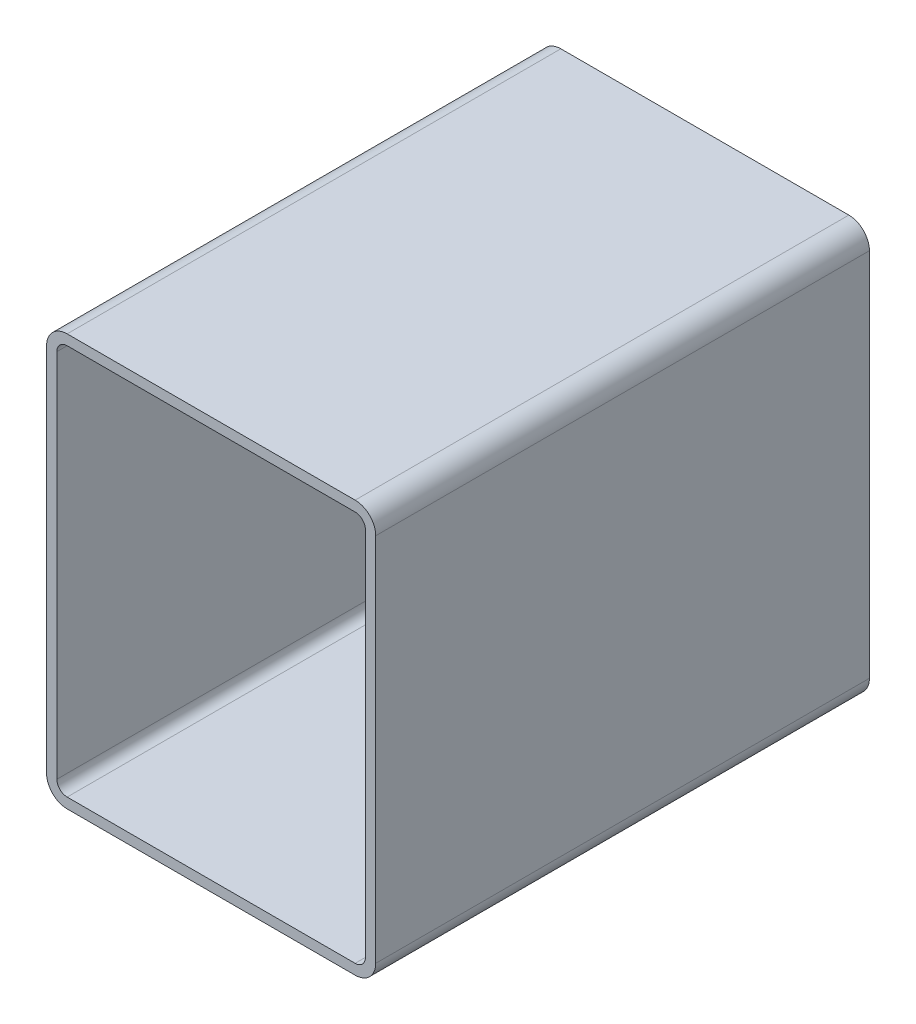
ISO-10303-21;
HEADER;
FILE_DESCRIPTION(('STEP AP214'),'2;1');
FILE_NAME('part.step','',(''),(''),'','','');
FILE_SCHEMA(('AUTOMOTIVE_DESIGN { 1 0 10303 214 1 1 1 1 }'));
ENDSEC;
DATA;
#1=APPLICATION_CONTEXT('core data for automotive mechanical design processes');
#2=APPLICATION_PROTOCOL_DEFINITION('international standard','automotive_design',2000,#1);
#3=PRODUCT_CONTEXT('',#1,'mechanical');
#4=PRODUCT('Part','Part','',(#3));
#5=PRODUCT_RELATED_PRODUCT_CATEGORY('part','',(#4));
#6=PRODUCT_DEFINITION_FORMATION('','',#4);
#7=PRODUCT_DEFINITION_CONTEXT('part definition',#1,'design');
#8=PRODUCT_DEFINITION('design','',#6,#7);
#9=PRODUCT_DEFINITION_SHAPE('','',#8);
#10=(LENGTH_UNIT() NAMED_UNIT(*) SI_UNIT(.MILLI.,.METRE.));
#11=(NAMED_UNIT(*) PLANE_ANGLE_UNIT() SI_UNIT($,.RADIAN.));
#12=(NAMED_UNIT(*) SI_UNIT($,.STERADIAN.) SOLID_ANGLE_UNIT());
#13=UNCERTAINTY_MEASURE_WITH_UNIT(LENGTH_MEASURE(1.E-05),#10,'distance_accuracy_value','');
#14=(GEOMETRIC_REPRESENTATION_CONTEXT(3) GLOBAL_UNCERTAINTY_ASSIGNED_CONTEXT((#13)) GLOBAL_UNIT_ASSIGNED_CONTEXT((#10,
#11,#12)) REPRESENTATION_CONTEXT('',''));
#15=CARTESIAN_POINT('',(0.,0.,0.));
#16=DIRECTION('',(0.,0.,1.));
#17=DIRECTION('',(1.,0.,0.));
#18=AXIS2_PLACEMENT_3D('',#15,#16,#17);
#19=CARTESIAN_POINT('',(14.0909404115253,243.220313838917,304.8));
#20=DIRECTION('',(0.,0.,1.));
#21=DIRECTION('',(1.,0.,0.));
#22=AXIS2_PLACEMENT_3D('',#19,#20,#21);
#23=PLANE('',#22);
#24=CARTESIAN_POINT('',(14.0909404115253,243.220313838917,304.8));
#25=DIRECTION('',(0.,0.,1.));
#26=DIRECTION('',(1.,0.,0.));
#27=AXIS2_PLACEMENT_3D('',#24,#25,#26);
#28=CIRCLE('',#27,12.7);
#29=CARTESIAN_POINT('',(14.0909404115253,255.920313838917,304.8));
#30=VERTEX_POINT('',#29);
#31=CARTESIAN_POINT('',(1.3909404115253,243.220313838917,304.8));
#32=VERTEX_POINT('',#31);
#33=EDGE_CURVE('E211',#30,#32,#28,.T.);
#34=ORIENTED_EDGE('',*,*,#33,.T.);
#35=DIRECTION('',(0.,-1.,0.));
#36=VECTOR('',#35,1.);
#37=CARTESIAN_POINT('',(1.3909404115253,14.6203138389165,304.8));
#38=LINE('',#37,#36);
#39=CARTESIAN_POINT('',(1.3909404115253,14.6203138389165,304.8));
#40=VERTEX_POINT('',#39);
#41=EDGE_CURVE('E214',#32,#40,#38,.T.);
#42=ORIENTED_EDGE('',*,*,#41,.T.);
#43=CARTESIAN_POINT('',(14.0909404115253,14.6203138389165,304.8));
#44=DIRECTION('',(0.,0.,1.));
#45=DIRECTION('',(1.,0.,0.));
#46=AXIS2_PLACEMENT_3D('',#43,#44,#45);
#47=CIRCLE('',#46,12.7);
#48=CARTESIAN_POINT('',(14.0909404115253,1.92031383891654,304.8));
#49=VERTEX_POINT('',#48);
#50=EDGE_CURVE('E217',#40,#49,#47,.T.);
#51=ORIENTED_EDGE('',*,*,#50,.T.);
#52=DIRECTION('',(1.,0.,0.));
#53=VECTOR('',#52,1.);
#54=CARTESIAN_POINT('',(191.890940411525,1.92031383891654,304.8));
#55=LINE('',#54,#53);
#56=CARTESIAN_POINT('',(191.890940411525,1.92031383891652,304.8));
#57=VERTEX_POINT('',#56);
#58=EDGE_CURVE('E219',#49,#57,#55,.T.);
#59=ORIENTED_EDGE('',*,*,#58,.T.);
#60=CARTESIAN_POINT('',(191.890940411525,14.6203138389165,304.8));
#61=DIRECTION('',(0.,0.,1.));
#62=DIRECTION('',(1.,0.,0.));
#63=AXIS2_PLACEMENT_3D('',#60,#61,#62);
#64=CIRCLE('',#63,12.7);
#65=CARTESIAN_POINT('',(204.590940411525,14.6203138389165,304.8));
#66=VERTEX_POINT('',#65);
#67=EDGE_CURVE('E221',#57,#66,#64,.T.);
#68=ORIENTED_EDGE('',*,*,#67,.T.);
#69=DIRECTION('',(0.,1.,0.));
#70=VECTOR('',#69,1.);
#71=CARTESIAN_POINT('',(204.590940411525,243.220313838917,304.8));
#72=LINE('',#71,#70);
#73=CARTESIAN_POINT('',(204.590940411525,243.220313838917,304.8));
#74=VERTEX_POINT('',#73);
#75=EDGE_CURVE('E223',#66,#74,#72,.T.);
#76=ORIENTED_EDGE('',*,*,#75,.T.);
#77=CARTESIAN_POINT('',(191.890940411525,243.220313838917,304.8));
#78=DIRECTION('',(0.,0.,1.));
#79=DIRECTION('',(1.,0.,0.));
#80=AXIS2_PLACEMENT_3D('',#77,#78,#79);
#81=CIRCLE('',#80,12.7);
#82=CARTESIAN_POINT('',(191.890940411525,255.920313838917,304.8));
#83=VERTEX_POINT('',#82);
#84=EDGE_CURVE('E225',#74,#83,#81,.T.);
#85=ORIENTED_EDGE('',*,*,#84,.T.);
#86=DIRECTION('',(-1.,0.,0.));
#87=VECTOR('',#86,1.);
#88=CARTESIAN_POINT('',(14.0909404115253,255.920313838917,304.8));
#89=LINE('',#88,#87);
#90=EDGE_CURVE('E227',#83,#30,#89,.T.);
#91=ORIENTED_EDGE('',*,*,#90,.T.);
#92=EDGE_LOOP('',(#34,#42,#51,#59,#68,#76,#85,#91));
#93=FACE_BOUND('',#92,.T.);
#94=DIRECTION('',(0.,-1.,0.));
#95=VECTOR('',#94,1.);
#96=CARTESIAN_POINT('',(7.7409404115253,14.6203138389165,304.8));
#97=LINE('',#96,#95);
#98=CARTESIAN_POINT('',(7.7409404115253,243.220313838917,304.8));
#99=VERTEX_POINT('',#98);
#100=CARTESIAN_POINT('',(7.7409404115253,14.6203138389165,304.8));
#101=VERTEX_POINT('',#100);
#102=EDGE_CURVE('E154',#99,#101,#97,.T.);
#103=ORIENTED_EDGE('',*,*,#102,.F.);
#104=CARTESIAN_POINT('',(14.0909404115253,243.220313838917,304.8));
#105=DIRECTION('',(0.,0.,1.));
#106=DIRECTION('',(1.,0.,0.));
#107=AXIS2_PLACEMENT_3D('',#104,#105,#106);
#108=CIRCLE('',#107,6.35000000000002);
#109=CARTESIAN_POINT('',(14.0909404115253,249.570313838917,304.8));
#110=VERTEX_POINT('',#109);
#111=EDGE_CURVE('E146',#110,#99,#108,.T.);
#112=ORIENTED_EDGE('',*,*,#111,.F.);
#113=DIRECTION('',(-1.,0.,0.));
#114=VECTOR('',#113,1.);
#115=CARTESIAN_POINT('',(14.0909404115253,249.570313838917,304.8));
#116=LINE('',#115,#114);
#117=CARTESIAN_POINT('',(191.890940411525,249.570313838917,304.8));
#118=VERTEX_POINT('',#117);
#119=EDGE_CURVE('E179',#118,#110,#116,.T.);
#120=ORIENTED_EDGE('',*,*,#119,.F.);
#121=CARTESIAN_POINT('',(191.890940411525,243.220313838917,304.8));
#122=DIRECTION('',(0.,0.,1.));
#123=DIRECTION('',(1.,0.,0.));
#124=AXIS2_PLACEMENT_3D('',#121,#122,#123);
#125=CIRCLE('',#124,6.35000000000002);
#126=CARTESIAN_POINT('',(198.240940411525,243.220313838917,304.8));
#127=VERTEX_POINT('',#126);
#128=EDGE_CURVE('E177',#127,#118,#125,.T.);
#129=ORIENTED_EDGE('',*,*,#128,.F.);
#130=DIRECTION('',(0.,1.,0.));
#131=VECTOR('',#130,1.);
#132=CARTESIAN_POINT('',(198.240940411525,243.220313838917,304.8));
#133=LINE('',#132,#131);
#134=CARTESIAN_POINT('',(198.240940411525,14.6203138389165,304.8));
#135=VERTEX_POINT('',#134);
#136=EDGE_CURVE('E175',#135,#127,#133,.T.);
#137=ORIENTED_EDGE('',*,*,#136,.F.);
#138=CARTESIAN_POINT('',(191.890940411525,14.6203138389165,304.8));
#139=DIRECTION('',(0.,0.,1.));
#140=DIRECTION('',(1.,0.,0.));
#141=AXIS2_PLACEMENT_3D('',#138,#139,#140);
#142=CIRCLE('',#141,6.35000000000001);
#143=CARTESIAN_POINT('',(191.890940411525,8.27031383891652,304.8));
#144=VERTEX_POINT('',#143);
#145=EDGE_CURVE('E173',#144,#135,#142,.T.);
#146=ORIENTED_EDGE('',*,*,#145,.F.);
#147=DIRECTION('',(1.,0.,0.));
#148=VECTOR('',#147,1.);
#149=CARTESIAN_POINT('',(191.890940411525,8.27031383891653,304.8));
#150=LINE('',#149,#148);
#151=CARTESIAN_POINT('',(14.0909404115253,8.27031383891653,304.8));
#152=VERTEX_POINT('',#151);
#153=EDGE_CURVE('E169',#152,#144,#150,.T.);
#154=ORIENTED_EDGE('',*,*,#153,.F.);
#155=CARTESIAN_POINT('',(14.0909404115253,14.6203138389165,304.8));
#156=DIRECTION('',(0.,0.,1.));
#157=DIRECTION('',(1.,0.,0.));
#158=AXIS2_PLACEMENT_3D('',#155,#156,#157);
#159=CIRCLE('',#158,6.35);
#160=EDGE_CURVE('E167',#101,#152,#159,.T.);
#161=ORIENTED_EDGE('',*,*,#160,.F.);
#162=EDGE_LOOP('',(#103,#112,#120,#129,#137,#146,#154,#161));
#163=FACE_BOUND('',#162,.T.);
#164=ADVANCED_FACE('F33',(#93,#163),#23,.T.);
#165=CARTESIAN_POINT('',(14.0909404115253,243.220313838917,0.));
#166=DIRECTION('',(0.,0.,1.));
#167=DIRECTION('',(1.,0.,0.));
#168=AXIS2_PLACEMENT_3D('',#165,#166,#167);
#169=PLANE('',#168);
#170=CARTESIAN_POINT('',(14.0909404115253,243.220313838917,0.));
#171=DIRECTION('',(0.,0.,1.));
#172=DIRECTION('',(1.,0.,0.));
#173=AXIS2_PLACEMENT_3D('',#170,#171,#172);
#174=CIRCLE('',#173,12.7);
#175=CARTESIAN_POINT('',(14.0909404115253,255.920313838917,0.));
#176=VERTEX_POINT('',#175);
#177=CARTESIAN_POINT('',(1.3909404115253,243.220313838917,0.));
#178=VERTEX_POINT('',#177);
#179=EDGE_CURVE('E162',#176,#178,#174,.T.);
#180=ORIENTED_EDGE('',*,*,#179,.F.);
#181=DIRECTION('',(-1.,0.,0.));
#182=VECTOR('',#181,1.);
#183=CARTESIAN_POINT('',(14.0909404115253,255.920313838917,0.));
#184=LINE('',#183,#182);
#185=CARTESIAN_POINT('',(191.890940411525,255.920313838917,0.));
#186=VERTEX_POINT('',#185);
#187=EDGE_CURVE('E215',#186,#176,#184,.T.);
#188=ORIENTED_EDGE('',*,*,#187,.F.);
#189=CARTESIAN_POINT('',(191.890940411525,243.220313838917,0.));
#190=DIRECTION('',(0.,0.,1.));
#191=DIRECTION('',(1.,0.,0.));
#192=AXIS2_PLACEMENT_3D('',#189,#190,#191);
#193=CIRCLE('',#192,12.7);
#194=CARTESIAN_POINT('',(204.590940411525,243.220313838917,0.));
#195=VERTEX_POINT('',#194);
#196=EDGE_CURVE('E242',#195,#186,#193,.T.);
#197=ORIENTED_EDGE('',*,*,#196,.F.);
#198=DIRECTION('',(0.,1.,0.));
#199=VECTOR('',#198,1.);
#200=CARTESIAN_POINT('',(204.590940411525,243.220313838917,0.));
#201=LINE('',#200,#199);
#202=CARTESIAN_POINT('',(204.590940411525,14.6203138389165,0.));
#203=VERTEX_POINT('',#202);
#204=EDGE_CURVE('E240',#203,#195,#201,.T.);
#205=ORIENTED_EDGE('',*,*,#204,.F.);
#206=CARTESIAN_POINT('',(191.890940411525,14.6203138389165,0.));
#207=DIRECTION('',(0.,0.,1.));
#208=DIRECTION('',(1.,0.,0.));
#209=AXIS2_PLACEMENT_3D('',#206,#207,#208);
#210=CIRCLE('',#209,12.7);
#211=CARTESIAN_POINT('',(191.890940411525,1.92031383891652,0.));
#212=VERTEX_POINT('',#211);
#213=EDGE_CURVE('E238',#212,#203,#210,.T.);
#214=ORIENTED_EDGE('',*,*,#213,.F.);
#215=DIRECTION('',(1.,0.,0.));
#216=VECTOR('',#215,1.);
#217=CARTESIAN_POINT('',(191.890940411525,1.92031383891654,0.));
#218=LINE('',#217,#216);
#219=CARTESIAN_POINT('',(14.0909404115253,1.92031383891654,0.));
#220=VERTEX_POINT('',#219);
#221=EDGE_CURVE('E236',#220,#212,#218,.T.);
#222=ORIENTED_EDGE('',*,*,#221,.F.);
#223=CARTESIAN_POINT('',(14.0909404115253,14.6203138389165,0.));
#224=DIRECTION('',(0.,0.,1.));
#225=DIRECTION('',(1.,0.,0.));
#226=AXIS2_PLACEMENT_3D('',#223,#224,#225);
#227=CIRCLE('',#226,12.7);
#228=CARTESIAN_POINT('',(1.3909404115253,14.6203138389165,0.));
#229=VERTEX_POINT('',#228);
#230=EDGE_CURVE('E234',#229,#220,#227,.T.);
#231=ORIENTED_EDGE('',*,*,#230,.F.);
#232=DIRECTION('',(0.,-1.,0.));
#233=VECTOR('',#232,1.);
#234=CARTESIAN_POINT('',(1.3909404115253,14.6203138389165,0.));
#235=LINE('',#234,#233);
#236=EDGE_CURVE('E232',#178,#229,#235,.T.);
#237=ORIENTED_EDGE('',*,*,#236,.F.);
#238=EDGE_LOOP('',(#180,#188,#197,#205,#214,#222,#231,#237));
#239=FACE_BOUND('',#238,.T.);
#240=CARTESIAN_POINT('',(14.0909404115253,243.220313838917,0.));
#241=DIRECTION('',(0.,0.,1.));
#242=DIRECTION('',(1.,0.,0.));
#243=AXIS2_PLACEMENT_3D('',#240,#241,#242);
#244=CIRCLE('',#243,6.35000000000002);
#245=CARTESIAN_POINT('',(14.0909404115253,249.570313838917,0.));
#246=VERTEX_POINT('',#245);
#247=CARTESIAN_POINT('',(7.7409404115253,243.220313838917,0.));
#248=VERTEX_POINT('',#247);
#249=EDGE_CURVE('E56',#246,#248,#244,.T.);
#250=ORIENTED_EDGE('',*,*,#249,.T.);
#251=DIRECTION('',(0.,-1.,0.));
#252=VECTOR('',#251,1.);
#253=CARTESIAN_POINT('',(7.7409404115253,14.6203138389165,0.));
#254=LINE('',#253,#252);
#255=CARTESIAN_POINT('',(7.7409404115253,14.6203138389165,0.));
#256=VERTEX_POINT('',#255);
#257=EDGE_CURVE('E161',#248,#256,#254,.T.);
#258=ORIENTED_EDGE('',*,*,#257,.T.);
#259=CARTESIAN_POINT('',(14.0909404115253,14.6203138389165,0.));
#260=DIRECTION('',(0.,0.,1.));
#261=DIRECTION('',(1.,0.,0.));
#262=AXIS2_PLACEMENT_3D('',#259,#260,#261);
#263=CIRCLE('',#262,6.35);
#264=CARTESIAN_POINT('',(14.0909404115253,8.27031383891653,0.));
#265=VERTEX_POINT('',#264);
#266=EDGE_CURVE('E183',#256,#265,#263,.T.);
#267=ORIENTED_EDGE('',*,*,#266,.T.);
#268=DIRECTION('',(1.,0.,0.));
#269=VECTOR('',#268,1.);
#270=CARTESIAN_POINT('',(191.890940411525,8.27031383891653,0.));
#271=LINE('',#270,#269);
#272=CARTESIAN_POINT('',(191.890940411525,8.27031383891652,0.));
#273=VERTEX_POINT('',#272);
#274=EDGE_CURVE('E186',#265,#273,#271,.T.);
#275=ORIENTED_EDGE('',*,*,#274,.T.);
#276=CARTESIAN_POINT('',(191.890940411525,14.6203138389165,0.));
#277=DIRECTION('',(0.,0.,1.));
#278=DIRECTION('',(1.,0.,0.));
#279=AXIS2_PLACEMENT_3D('',#276,#277,#278);
#280=CIRCLE('',#279,6.35000000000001);
#281=CARTESIAN_POINT('',(198.240940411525,14.6203138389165,0.));
#282=VERTEX_POINT('',#281);
#283=EDGE_CURVE('E189',#273,#282,#280,.T.);
#284=ORIENTED_EDGE('',*,*,#283,.T.);
#285=DIRECTION('',(0.,1.,0.));
#286=VECTOR('',#285,1.);
#287=CARTESIAN_POINT('',(198.240940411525,243.220313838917,0.));
#288=LINE('',#287,#286);
#289=CARTESIAN_POINT('',(198.240940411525,243.220313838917,0.));
#290=VERTEX_POINT('',#289);
#291=EDGE_CURVE('E192',#282,#290,#288,.T.);
#292=ORIENTED_EDGE('',*,*,#291,.T.);
#293=CARTESIAN_POINT('',(191.890940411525,243.220313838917,0.));
#294=DIRECTION('',(0.,0.,1.));
#295=DIRECTION('',(1.,0.,0.));
#296=AXIS2_PLACEMENT_3D('',#293,#294,#295);
#297=CIRCLE('',#296,6.35000000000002);
#298=CARTESIAN_POINT('',(191.890940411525,249.570313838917,0.));
#299=VERTEX_POINT('',#298);
#300=EDGE_CURVE('E195',#290,#299,#297,.T.);
#301=ORIENTED_EDGE('',*,*,#300,.T.);
#302=DIRECTION('',(-1.,0.,0.));
#303=VECTOR('',#302,1.);
#304=CARTESIAN_POINT('',(14.0909404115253,249.570313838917,0.));
#305=LINE('',#304,#303);
#306=EDGE_CURVE('E155',#299,#246,#305,.T.);
#307=ORIENTED_EDGE('',*,*,#306,.T.);
#308=EDGE_LOOP('',(#250,#258,#267,#275,#284,#292,#301,#307));
#309=FACE_BOUND('',#308,.T.);
#310=ADVANCED_FACE('F272',(#239,#309),#169,.F.);
#311=CARTESIAN_POINT('',(14.0909404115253,243.220313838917,304.8));
#312=DIRECTION('',(0.,0.,-1.));
#313=DIRECTION('',(-1.,0.,0.));
#314=AXIS2_PLACEMENT_3D('',#311,#312,#313);
#315=CYLINDRICAL_SURFACE('',#314,12.7);
#316=ORIENTED_EDGE('',*,*,#179,.T.);
#317=DIRECTION('',(0.,0.,-1.));
#318=VECTOR('',#317,1.);
#319=CARTESIAN_POINT('',(1.3909404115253,243.220313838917,304.8));
#320=LINE('',#319,#318);
#321=EDGE_CURVE('E11',#32,#178,#320,.T.);
#322=ORIENTED_EDGE('',*,*,#321,.F.);
#323=ORIENTED_EDGE('',*,*,#33,.F.);
#324=DIRECTION('',(0.,0.,-1.));
#325=VECTOR('',#324,1.);
#326=CARTESIAN_POINT('',(14.0909404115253,255.920313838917,304.8));
#327=LINE('',#326,#325);
#328=EDGE_CURVE('E229',#30,#176,#327,.T.);
#329=ORIENTED_EDGE('',*,*,#328,.T.);
#330=EDGE_LOOP('',(#316,#322,#323,#329));
#331=FACE_BOUND('',#330,.T.);
#332=ADVANCED_FACE('F35',(#331),#315,.T.);
#333=CARTESIAN_POINT('',(1.3909404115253,14.6203138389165,304.8));
#334=DIRECTION('',(1.,0.,0.));
#335=DIRECTION('',(0.,0.,-1.));
#336=AXIS2_PLACEMENT_3D('',#333,#334,#335);
#337=PLANE('',#336);
#338=ORIENTED_EDGE('',*,*,#236,.T.);
#339=DIRECTION('',(0.,0.,-1.));
#340=VECTOR('',#339,1.);
#341=CARTESIAN_POINT('',(1.3909404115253,14.6203138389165,304.8));
#342=LINE('',#341,#340);
#343=EDGE_CURVE('E41',#40,#229,#342,.T.);
#344=ORIENTED_EDGE('',*,*,#343,.F.);
#345=ORIENTED_EDGE('',*,*,#41,.F.);
#346=ORIENTED_EDGE('',*,*,#321,.T.);
#347=EDGE_LOOP('',(#338,#344,#345,#346));
#348=FACE_BOUND('',#347,.T.);
#349=ADVANCED_FACE('F289',(#348),#337,.F.);
#350=CARTESIAN_POINT('',(14.0909404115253,14.6203138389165,304.8));
#351=DIRECTION('',(0.,0.,-1.));
#352=DIRECTION('',(-1.,0.,0.));
#353=AXIS2_PLACEMENT_3D('',#350,#351,#352);
#354=CYLINDRICAL_SURFACE('',#353,12.7);
#355=ORIENTED_EDGE('',*,*,#230,.T.);
#356=DIRECTION('',(0.,0.,-1.));
#357=VECTOR('',#356,1.);
#358=CARTESIAN_POINT('',(14.0909404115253,1.92031383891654,304.8));
#359=LINE('',#358,#357);
#360=EDGE_CURVE('E259',#49,#220,#359,.T.);
#361=ORIENTED_EDGE('',*,*,#360,.F.);
#362=ORIENTED_EDGE('',*,*,#50,.F.);
#363=ORIENTED_EDGE('',*,*,#343,.T.);
#364=EDGE_LOOP('',(#355,#361,#362,#363));
#365=FACE_BOUND('',#364,.T.);
#366=ADVANCED_FACE('F266',(#365),#354,.T.);
#367=CARTESIAN_POINT('',(191.890940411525,1.92031383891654,304.8));
#368=DIRECTION('',(0.,1.,0.));
#369=DIRECTION('',(0.,0.,1.));
#370=AXIS2_PLACEMENT_3D('',#367,#368,#369);
#371=PLANE('',#370);
#372=ORIENTED_EDGE('',*,*,#221,.T.);
#373=DIRECTION('',(0.,0.,-1.));
#374=VECTOR('',#373,1.);
#375=CARTESIAN_POINT('',(191.890940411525,1.92031383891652,304.8));
#376=LINE('',#375,#374);
#377=EDGE_CURVE('E256',#57,#212,#376,.T.);
#378=ORIENTED_EDGE('',*,*,#377,.F.);
#379=ORIENTED_EDGE('',*,*,#58,.F.);
#380=ORIENTED_EDGE('',*,*,#360,.T.);
#381=EDGE_LOOP('',(#372,#378,#379,#380));
#382=FACE_BOUND('',#381,.T.);
#383=ADVANCED_FACE('F278',(#382),#371,.F.);
#384=CARTESIAN_POINT('',(191.890940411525,14.6203138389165,304.8));
#385=DIRECTION('',(0.,0.,-1.));
#386=DIRECTION('',(-1.,0.,0.));
#387=AXIS2_PLACEMENT_3D('',#384,#385,#386);
#388=CYLINDRICAL_SURFACE('',#387,12.7);
#389=ORIENTED_EDGE('',*,*,#213,.T.);
#390=DIRECTION('',(0.,0.,-1.));
#391=VECTOR('',#390,1.);
#392=CARTESIAN_POINT('',(204.590940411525,14.6203138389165,304.8));
#393=LINE('',#392,#391);
#394=EDGE_CURVE('E253',#66,#203,#393,.T.);
#395=ORIENTED_EDGE('',*,*,#394,.F.);
#396=ORIENTED_EDGE('',*,*,#67,.F.);
#397=ORIENTED_EDGE('',*,*,#377,.T.);
#398=EDGE_LOOP('',(#389,#395,#396,#397));
#399=FACE_BOUND('',#398,.T.);
#400=ADVANCED_FACE('F282',(#399),#388,.T.);
#401=CARTESIAN_POINT('',(204.590940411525,243.220313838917,304.8));
#402=DIRECTION('',(-1.,0.,0.));
#403=DIRECTION('',(0.,0.,1.));
#404=AXIS2_PLACEMENT_3D('',#401,#402,#403);
#405=PLANE('',#404);
#406=ORIENTED_EDGE('',*,*,#204,.T.);
#407=DIRECTION('',(0.,0.,-1.));
#408=VECTOR('',#407,1.);
#409=CARTESIAN_POINT('',(204.590940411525,243.220313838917,304.8));
#410=LINE('',#409,#408);
#411=EDGE_CURVE('E250',#74,#195,#410,.T.);
#412=ORIENTED_EDGE('',*,*,#411,.F.);
#413=ORIENTED_EDGE('',*,*,#75,.F.);
#414=ORIENTED_EDGE('',*,*,#394,.T.);
#415=EDGE_LOOP('',(#406,#412,#413,#414));
#416=FACE_BOUND('',#415,.T.);
#417=ADVANCED_FACE('F302',(#416),#405,.F.);
#418=CARTESIAN_POINT('',(191.890940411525,243.220313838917,304.8));
#419=DIRECTION('',(0.,0.,-1.));
#420=DIRECTION('',(-1.,0.,0.));
#421=AXIS2_PLACEMENT_3D('',#418,#419,#420);
#422=CYLINDRICAL_SURFACE('',#421,12.7);
#423=ORIENTED_EDGE('',*,*,#196,.T.);
#424=DIRECTION('',(0.,0.,-1.));
#425=VECTOR('',#424,1.);
#426=CARTESIAN_POINT('',(191.890940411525,255.920313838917,304.8));
#427=LINE('',#426,#425);
#428=EDGE_CURVE('E247',#83,#186,#427,.T.);
#429=ORIENTED_EDGE('',*,*,#428,.F.);
#430=ORIENTED_EDGE('',*,*,#84,.F.);
#431=ORIENTED_EDGE('',*,*,#411,.T.);
#432=EDGE_LOOP('',(#423,#429,#430,#431));
#433=FACE_BOUND('',#432,.T.);
#434=ADVANCED_FACE('F300',(#433),#422,.T.);
#435=CARTESIAN_POINT('',(14.0909404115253,255.920313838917,304.8));
#436=DIRECTION('',(0.,-1.,0.));
#437=DIRECTION('',(0.,0.,-1.));
#438=AXIS2_PLACEMENT_3D('',#435,#436,#437);
#439=PLANE('',#438);
#440=ORIENTED_EDGE('',*,*,#187,.T.);
#441=ORIENTED_EDGE('',*,*,#328,.F.);
#442=ORIENTED_EDGE('',*,*,#90,.F.);
#443=ORIENTED_EDGE('',*,*,#428,.T.);
#444=EDGE_LOOP('',(#440,#441,#442,#443));
#445=FACE_BOUND('',#444,.T.);
#446=ADVANCED_FACE('F295',(#445),#439,.F.);
#447=CARTESIAN_POINT('',(14.0909404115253,243.220313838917,304.8));
#448=DIRECTION('',(0.,0.,-1.));
#449=DIRECTION('',(-1.,0.,0.));
#450=AXIS2_PLACEMENT_3D('',#447,#448,#449);
#451=CYLINDRICAL_SURFACE('',#450,6.35000000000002);
#452=ORIENTED_EDGE('',*,*,#249,.F.);
#453=DIRECTION('',(0.,0.,-1.));
#454=VECTOR('',#453,1.);
#455=CARTESIAN_POINT('',(14.0909404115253,249.570313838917,304.8));
#456=LINE('',#455,#454);
#457=EDGE_CURVE('E150',#110,#246,#456,.T.);
#458=ORIENTED_EDGE('',*,*,#457,.F.);
#459=ORIENTED_EDGE('',*,*,#111,.T.);
#460=DIRECTION('',(0.,0.,-1.));
#461=VECTOR('',#460,1.);
#462=CARTESIAN_POINT('',(7.7409404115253,243.220313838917,304.8));
#463=LINE('',#462,#461);
#464=EDGE_CURVE('E149',#99,#248,#463,.T.);
#465=ORIENTED_EDGE('',*,*,#464,.T.);
#466=EDGE_LOOP('',(#452,#458,#459,#465));
#467=FACE_BOUND('',#466,.T.);
#468=ADVANCED_FACE('F148',(#467),#451,.F.);
#469=CARTESIAN_POINT('',(7.7409404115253,14.6203138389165,304.8));
#470=DIRECTION('',(1.,0.,0.));
#471=DIRECTION('',(0.,0.,-1.));
#472=AXIS2_PLACEMENT_3D('',#469,#470,#471);
#473=PLANE('',#472);
#474=ORIENTED_EDGE('',*,*,#257,.F.);
#475=ORIENTED_EDGE('',*,*,#464,.F.);
#476=ORIENTED_EDGE('',*,*,#102,.T.);
#477=DIRECTION('',(0.,0.,-1.));
#478=VECTOR('',#477,1.);
#479=CARTESIAN_POINT('',(7.7409404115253,14.6203138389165,304.8));
#480=LINE('',#479,#478);
#481=EDGE_CURVE('E163',#101,#256,#480,.T.);
#482=ORIENTED_EDGE('',*,*,#481,.T.);
#483=EDGE_LOOP('',(#474,#475,#476,#482));
#484=FACE_BOUND('',#483,.T.);
#485=ADVANCED_FACE('F158',(#484),#473,.T.);
#486=CARTESIAN_POINT('',(14.0909404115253,14.6203138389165,304.8));
#487=DIRECTION('',(0.,0.,-1.));
#488=DIRECTION('',(-1.,0.,0.));
#489=AXIS2_PLACEMENT_3D('',#486,#487,#488);
#490=CYLINDRICAL_SURFACE('',#489,6.35);
#491=ORIENTED_EDGE('',*,*,#266,.F.);
#492=ORIENTED_EDGE('',*,*,#481,.F.);
#493=ORIENTED_EDGE('',*,*,#160,.T.);
#494=DIRECTION('',(0.,0.,-1.));
#495=VECTOR('',#494,1.);
#496=CARTESIAN_POINT('',(14.0909404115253,8.27031383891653,304.8));
#497=LINE('',#496,#495);
#498=EDGE_CURVE('E208',#152,#265,#497,.T.);
#499=ORIENTED_EDGE('',*,*,#498,.T.);
#500=EDGE_LOOP('',(#491,#492,#493,#499));
#501=FACE_BOUND('',#500,.T.);
#502=ADVANCED_FACE('F327',(#501),#490,.F.);
#503=CARTESIAN_POINT('',(191.890940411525,8.27031383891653,304.8));
#504=DIRECTION('',(0.,1.,0.));
#505=DIRECTION('',(0.,0.,1.));
#506=AXIS2_PLACEMENT_3D('',#503,#504,#505);
#507=PLANE('',#506);
#508=ORIENTED_EDGE('',*,*,#274,.F.);
#509=ORIENTED_EDGE('',*,*,#498,.F.);
#510=ORIENTED_EDGE('',*,*,#153,.T.);
#511=DIRECTION('',(0.,0.,-1.));
#512=VECTOR('',#511,1.);
#513=CARTESIAN_POINT('',(191.890940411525,8.27031383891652,304.8));
#514=LINE('',#513,#512);
#515=EDGE_CURVE('E206',#144,#273,#514,.T.);
#516=ORIENTED_EDGE('',*,*,#515,.T.);
#517=EDGE_LOOP('',(#508,#509,#510,#516));
#518=FACE_BOUND('',#517,.T.);
#519=ADVANCED_FACE('F331',(#518),#507,.T.);
#520=CARTESIAN_POINT('',(191.890940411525,14.6203138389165,304.8));
#521=DIRECTION('',(0.,0.,-1.));
#522=DIRECTION('',(-1.,0.,0.));
#523=AXIS2_PLACEMENT_3D('',#520,#521,#522);
#524=CYLINDRICAL_SURFACE('',#523,6.35000000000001);
#525=ORIENTED_EDGE('',*,*,#283,.F.);
#526=ORIENTED_EDGE('',*,*,#515,.F.);
#527=ORIENTED_EDGE('',*,*,#145,.T.);
#528=DIRECTION('',(0.,0.,-1.));
#529=VECTOR('',#528,1.);
#530=CARTESIAN_POINT('',(198.240940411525,14.6203138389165,304.8));
#531=LINE('',#530,#529);
#532=EDGE_CURVE('E204',#135,#282,#531,.T.);
#533=ORIENTED_EDGE('',*,*,#532,.T.);
#534=EDGE_LOOP('',(#525,#526,#527,#533));
#535=FACE_BOUND('',#534,.T.);
#536=ADVANCED_FACE('F337',(#535),#524,.F.);
#537=CARTESIAN_POINT('',(198.240940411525,243.220313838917,304.8));
#538=DIRECTION('',(-1.,0.,0.));
#539=DIRECTION('',(0.,0.,1.));
#540=AXIS2_PLACEMENT_3D('',#537,#538,#539);
#541=PLANE('',#540);
#542=ORIENTED_EDGE('',*,*,#291,.F.);
#543=ORIENTED_EDGE('',*,*,#532,.F.);
#544=ORIENTED_EDGE('',*,*,#136,.T.);
#545=DIRECTION('',(0.,0.,-1.));
#546=VECTOR('',#545,1.);
#547=CARTESIAN_POINT('',(198.240940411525,243.220313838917,304.8));
#548=LINE('',#547,#546);
#549=EDGE_CURVE('E202',#127,#290,#548,.T.);
#550=ORIENTED_EDGE('',*,*,#549,.T.);
#551=EDGE_LOOP('',(#542,#543,#544,#550));
#552=FACE_BOUND('',#551,.T.);
#553=ADVANCED_FACE('F341',(#552),#541,.T.);
#554=CARTESIAN_POINT('',(191.890940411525,243.220313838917,304.8));
#555=DIRECTION('',(0.,0.,-1.));
#556=DIRECTION('',(-1.,0.,0.));
#557=AXIS2_PLACEMENT_3D('',#554,#555,#556);
#558=CYLINDRICAL_SURFACE('',#557,6.35000000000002);
#559=ORIENTED_EDGE('',*,*,#300,.F.);
#560=ORIENTED_EDGE('',*,*,#549,.F.);
#561=ORIENTED_EDGE('',*,*,#128,.T.);
#562=DIRECTION('',(0.,0.,-1.));
#563=VECTOR('',#562,1.);
#564=CARTESIAN_POINT('',(191.890940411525,249.570313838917,304.8));
#565=LINE('',#564,#563);
#566=EDGE_CURVE('E48',#118,#299,#565,.T.);
#567=ORIENTED_EDGE('',*,*,#566,.T.);
#568=EDGE_LOOP('',(#559,#560,#561,#567));
#569=FACE_BOUND('',#568,.T.);
#570=ADVANCED_FACE('F345',(#569),#558,.F.);
#571=CARTESIAN_POINT('',(14.0909404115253,249.570313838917,304.8));
#572=DIRECTION('',(0.,-1.,0.));
#573=DIRECTION('',(0.,0.,-1.));
#574=AXIS2_PLACEMENT_3D('',#571,#572,#573);
#575=PLANE('',#574);
#576=ORIENTED_EDGE('',*,*,#306,.F.);
#577=ORIENTED_EDGE('',*,*,#566,.F.);
#578=ORIENTED_EDGE('',*,*,#119,.T.);
#579=ORIENTED_EDGE('',*,*,#457,.T.);
#580=EDGE_LOOP('',(#576,#577,#578,#579));
#581=FACE_BOUND('',#580,.T.);
#582=ADVANCED_FACE('F349',(#581),#575,.T.);
#583=CLOSED_SHELL('',(#164,#310,#332,#349,#366,#383,#400,#417,#434,#446,#468,#485,#502,#519,
#536,#553,#570,#582));
#584=MANIFOLD_SOLID_BREP('B2',#583);
#585=ADVANCED_BREP_SHAPE_REPRESENTATION('',(#18,#584),#14);
#586=SHAPE_DEFINITION_REPRESENTATION(#9,#585);
ENDSEC;
END-ISO-10303-21;
